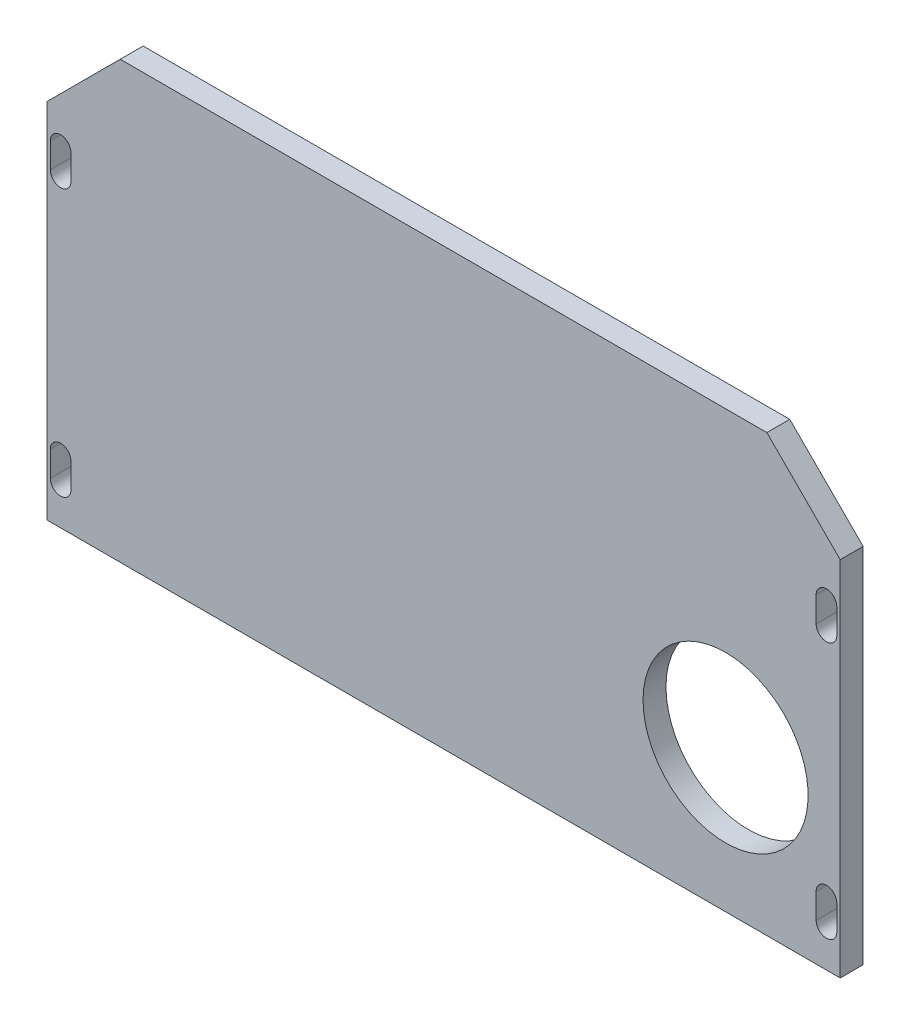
from build123d import *

# Parameters (mm, degrees)
SKETCH_1_W          = 173
SKETCH_1_H          = 95
EXTRUDE_1_DEPTH     = 5
SKETCH_2_R          = 18
CUT_EXTRUDE_1_DEPTH = 198.431000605
CHAMFER_1_SIZE      = 16


with BuildPart() as part:
    # Sketch 1 → Extrude 1 (new body)
    with BuildSketch(Plane.XY):
        with Locations((86.5, 47.5)):
            Rectangle(SKETCH_1_W, SKETCH_1_H)
    extrude(amount=EXTRUDE_1_DEPTH)

    # Sketch 2 → Cut-Extrude 1 (cut, through all)
    with BuildSketch(Plane(origin=(0, 0, 0), x_dir=(-1, 0, 0), z_dir=(0, 0, -1))):
        with Locations((-148, 31)):
            Circle(SKETCH_2_R)
        with BuildLine():
            Line((-167.75, 69.75), (-167.75, 64.25))
            ThreePointArc((-167.75, 64.25), (-170, 62), (-172.25, 64.25))
            Line((-172.25, 64.25), (-172.25, 69.75))
            ThreePointArc((-172.25, 69.75), (-170, 72), (-167.75, 69.75))
        make_face()
        with BuildLine():
            Line((-167.75, 13.75), (-167.75, 8.25))
            ThreePointArc((-167.75, 8.25), (-170, 6), (-172.25, 8.25))
            Line((-172.25, 8.25), (-172.25, 13.75))
            ThreePointArc((-172.25, 13.75), (-170, 16), (-167.75, 13.75))
        make_face()
        with BuildLine():
            Line((-0.75, 72), (-0.75, 66.5))
            ThreePointArc((-0.75, 66.5), (-3, 64.25), (-5.25, 66.5))
            Line((-5.25, 66.5), (-5.25, 72))
            ThreePointArc((-5.25, 72), (-3, 74.25), (-0.75, 72))
        make_face()
        with BuildLine():
            Line((-0.75, 13.75), (-0.75, 8.25))
            ThreePointArc((-0.75, 8.25), (-3, 6), (-5.25, 8.25))
            Line((-5.25, 8.25), (-5.25, 13.75))
            ThreePointArc((-5.25, 13.75), (-3, 16), (-0.75, 13.75))
        make_face()
    extrude(amount=-CUT_EXTRUDE_1_DEPTH, mode=Mode.SUBTRACT)

    # Chamfer 1
    chamfer_1_edges = [part.edges().sort_by_distance(p)[0] for p in [
        (0, 95, 2.5),
        (173, 95, 2.5),
    ]]
    chamfer(chamfer_1_edges, length=CHAMFER_1_SIZE)


solid = part.part
